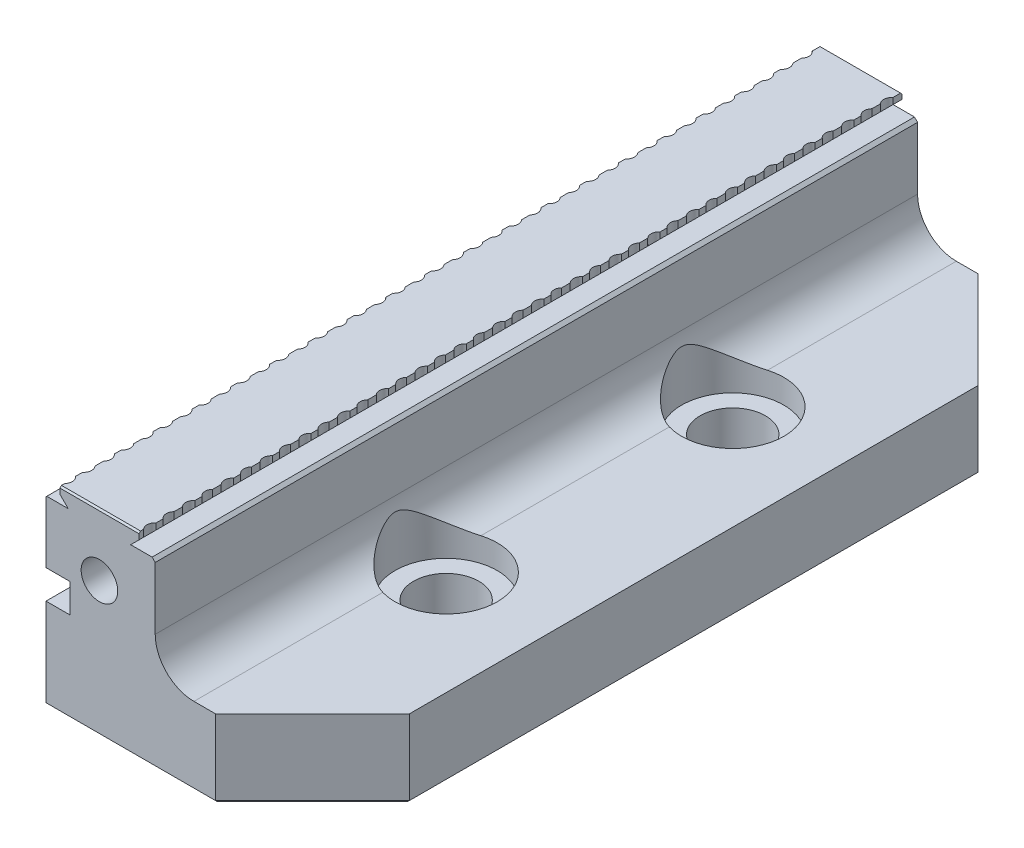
from build123d import *

# Parameters (mm, degrees)
BOSS_EXTRUDE1_DEPTH                = 62.5
CUT_EXTRUDE1_JAW_TOOTH_REACH       = 75.704
LPATTERN1_COUNT                    = 20
LPATTERN1_PITCH                    = 6.35762
CBORE_FOR_M10_SHCS1_D              = 10.7188
CBORE_FOR_M10_SHCS1_CBORE_D        = 16.764
CBORE_FOR_M10_SHCS1_CBORE_DEPTH    = 23.5
F_8_0MM_DOWEL_HOLE1_D              = 8.01623567
F_8_0MM_DOWEL_HOLE1_DEPTH          = 6.858
CHAMFER1_SIZE                      = 15.875
CHAMFER2_SIZE                      = 0.254
SKETCH9_W                          = 4.318
SKETCH9_H                          = 4.7498
CUT_EXTRUDE1_STOP_GROOVE_DEPTH     = 128.947895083
STEP_CHAMFER_SIZE                  = 0.381
OUTSIDE_DOVETAIL_CHAMFER_SIZE      = 0.508
INSIDE_DOVETAIL_CHAMFER_SIZE       = 0.508
BOTTOM_OUTSIDE_EDGE_CHAMFER_SIZE   = 0.381
OUTSIDE_JAW_FACE_EDGE_CHAMFER_SIZE = 0.381
FRONT_JAW_FACE_CHAMFERED_EDGE_SIZE = 0.381


with BuildPart() as part:
    # Sketch1 → Boss-Extrude1 (new, symmetric)
    with BuildSketch(Plane.XY):
        with BuildLine():
            Line((-22.0345, -16.129), (22.0345, -16.129))
            Line((22.0345, -16.129), (22.0345, -3.429))
            Line((22.0345, -3.429), (2.6035, -3.429))
            ThreePointArc((2.6035, -3.429), (-1.886628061, -1.569128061), (-3.7465, 2.921))
            Line((-3.7465, 2.921), (-3.7465, 13.629))
            Line((-3.7465, 13.629), (-7.7705, 13.629))
            Line((-7.7705, 13.629), (-6.2865, 15.113))
            Line((-6.2865, 15.113), (-6.2865, 16.129))
            Line((-6.2865, 16.129), (-19.4945, 16.129))
            Line((-19.4945, 16.129), (-19.4945, 15.113))
            Line((-19.4945, 15.113), (-18.0105, 13.629))
            Line((-18.0105, 13.629), (-22.0345, 13.629))
            Line((-22.0345, 13.629), (-22.0345, -16.129))
        make_face()
    extrude(amount=BOSS_EXTRUDE1_DEPTH, both=True)

    # Sketch8 → Cut-Extrude1 JAW TOOTH (cut, up to next)
    with BuildSketch(Plane(origin=(0, 16.129, 0), x_dir=(1, 0, 0), z_dir=(0, 1, 0)), mode=Mode.PRIVATE) as cut_extrude1_jaw_tooth_sk1:
        with BuildLine():
            Line((-19.4945, 62.5), (-19.4945, 60.976))
            ThreePointArc((-19.4945, 60.976), (-19.015440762, 60.048590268), (-19.3675, 59.06592))
            Line((-19.3675, 59.06592), (-19.3675, 57.67908))
            ThreePointArc((-19.3675, 57.67908), (-19.015440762, 56.696409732), (-19.4945, 55.769))
            Line((-19.4945, 55.769), (-22.233870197, 55.769))
            Line((-22.233870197, 55.769), (-22.233870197, 62.5))
            Line((-22.233870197, 62.5), (-19.4945, 62.5))
        make_face()
    cut_extrude1_jaw_tooth_tool1 = extrude(cut_extrude1_jaw_tooth_sk1.sketch, amount=-CUT_EXTRUDE1_JAW_TOOTH_REACH, mode=Mode.PRIVATE) & part.part
    # Sketch8 → Cut-Extrude1 JAW TOOTH (cut, up to next)
    with BuildSketch(Plane(origin=(0, 16.129, 0), x_dir=(1, 0, 0), z_dir=(0, 1, 0)), mode=Mode.PRIVATE) as cut_extrude1_jaw_tooth_sk2:
        with BuildLine():
            Line((-3.547129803, 62.5), (-6.2865, 62.5))
            Line((-6.2865, 62.5), (-6.2865, 60.976))
            ThreePointArc((-6.2865, 60.976), (-6.765559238, 60.048590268), (-6.4135, 59.06592))
            Line((-6.4135, 59.06592), (-6.4135, 57.67908))
            ThreePointArc((-6.4135, 57.67908), (-6.765559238, 56.696409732), (-6.2865, 55.769))
            Line((-6.2865, 55.769), (-3.547129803, 55.769))
            Line((-3.547129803, 55.769), (-3.547129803, 62.5))
        make_face()
    cut_extrude1_jaw_tooth_tool2 = extrude(cut_extrude1_jaw_tooth_sk2.sketch, amount=-CUT_EXTRUDE1_JAW_TOOTH_REACH, mode=Mode.PRIVATE) & part.part
    cut_extrude1_jaw_tooth_1 = cut_extrude1_jaw_tooth_tool1.solids().sort_by_distance((-20.745914, 16.129, -59.076435))[0]
    add(cut_extrude1_jaw_tooth_1, mode=Mode.SUBTRACT)
    cut_extrude1_jaw_tooth_2 = cut_extrude1_jaw_tooth_tool2.solids().sort_by_distance((-5.035086, 16.129, -59.076435))[0]
    add(cut_extrude1_jaw_tooth_2, mode=Mode.SUBTRACT)
    cut_extrude1_jaw_tooth = cut_extrude1_jaw_tooth_1 + cut_extrude1_jaw_tooth_2  # Cut-Extrude1 JAW TOOTH as one shape, for the pattern or mirror that repeats it

    # LPattern1: Cut-Extrude1 JAW TOOTH ×20
    with Locations(*[(0, 0, i * LPATTERN1_PITCH) for i in range(1, LPATTERN1_COUNT)]):
        add(cut_extrude1_jaw_tooth, mode=Mode.SUBTRACT)

    # CBORE for M10 SHCS1 (through all)
    with Locations(Plane(origin=(0, 16.129, 0), x_dir=(-1, 0, 0), z_dir=(0, 1, 0))):
        with Locations((-4.953, -23.495), (-4.953, 23.495)):
            CounterBoreHole(CBORE_FOR_M10_SHCS1_D / 2, CBORE_FOR_M10_SHCS1_CBORE_D / 2, CBORE_FOR_M10_SHCS1_CBORE_DEPTH)

    # 8.0mm Dowel Hole1
    with Locations(Plane.XZ.offset(16.129)):
        with Locations((16.652999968, 23.5), (-6.746999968, -23.5)):
            Hole(F_8_0MM_DOWEL_HOLE1_D / 2, depth=F_8_0MM_DOWEL_HOLE1_DEPTH)

    # Chamfer1
    chamfer1_edges = [part.edges().sort_by_distance(p)[0] for p in [
        (22.0345, -9.779, 62.5),
        (22.0345, -9.779, -62.5),
    ]]
    chamfer(chamfer1_edges, length=CHAMFER1_SIZE)

    # Chamfer2
    chamfer2_edges = [part.edges().sort_by_distance(p)[0] for p in [
        (-12.8905, 16.129, -62.5),
        (-12.8905, 16.129, 62.5),
    ]]
    chamfer(chamfer2_edges, length=CHAMFER2_SIZE)

    # Sketch9 → Cut-Extrude1 STOP GROOVE (cut, through all)
    with BuildSketch(Plane(origin=(0, 0, -62.5), x_dir=(-1, 0, 0), z_dir=(0, 0, -1))):
        with Locations((19.8755, 1.0541)):
            Rectangle(SKETCH9_W, SKETCH9_H)
    extrude(amount=-CUT_EXTRUDE1_STOP_GROOVE_DEPTH, mode=Mode.SUBTRACT)

    # Sketch13 → M6x1.0 Tapped Hole1 (revolve, cut)
    with BuildSketch(Plane(origin=(-12.8905, 5.969, -62.5), x_dir=(0, 1, 0), z_dir=(1, 0, 0))):
        Polygon((0, 0), (0, 16.488151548), (2.5, 14.986), (2.5, 11.9888), (3, 11.9888), (3, 0), align=None)
    m6x1_0_tapped_hole1 = revolve(axis=Axis((-12.8905, 5.969, -68.85), (0, 0, 1)), mode=Mode.SUBTRACT)

    # Mirror1: M6x1.0 Tapped Hole1 across plane
    add(m6x1_0_tapped_hole1.mirror(Plane.XY), mode=Mode.SUBTRACT)

    # STEP CHAMFER
    step_chamfer_edges = [part.edges().sort_by_distance(p)[0] for p in [
        (-22.0345, 3.429, 0),
        (-22.0345, -1.3208, 0),
    ]]
    chamfer(step_chamfer_edges, length=STEP_CHAMFER_SIZE)

    # OUTSIDE DOVETAIL CHAMFER
    outside_dovetail_chamfer_edges = [part.edges().sort_by_distance(p)[0] for p in [
        (-22.0345, 13.629, 0),
    ]]
    chamfer(outside_dovetail_chamfer_edges, length=OUTSIDE_DOVETAIL_CHAMFER_SIZE)

    # INSIDE DOVETAIL CHAMFER
    inside_dovetail_chamfer_edges = [part.edges().sort_by_distance(p)[0] for p in [
        (-3.7465, 13.629, 0),
    ]]
    chamfer(inside_dovetail_chamfer_edges, length=INSIDE_DOVETAIL_CHAMFER_SIZE)

    # BOTTOM OUTSIDE EDGE CHAMFER
    bottom_outside_edge_chamfer_edges = [part.edges().sort_by_distance(p)[0] for p in [
        (-7.9375, -16.129, -62.5),
        (-0.4064, -16.129, 23.495),
        (-0.4064, -16.129, -23.495),
        (22.0345, -16.129, 0),
        (14.097, -16.129, 54.5625),
        (14.097, -16.129, -54.5625),
        (-7.9375, -16.129, 62.5),
    ]]
    chamfer(bottom_outside_edge_chamfer_edges, length=BOTTOM_OUTSIDE_EDGE_CHAMFER_SIZE)

    # OUTSIDE JAW FACE EDGE CHAMFER
    outside_jaw_face_edge_chamfer_edges = [part.edges().sort_by_distance(p)[0] for p in [
        (-22.0345, 8.4655, -62.5),
        (-22.0345, -8.7249, -62.5),
        (-22.0345, 8.4655, 62.5),
        (-22.0345, -8.7249, 62.5),
    ]]
    chamfer(outside_jaw_face_edge_chamfer_edges, length=OUTSIDE_JAW_FACE_EDGE_CHAMFER_SIZE)

    # FRONT JAW FACE CHAMFERED EDGE
    front_jaw_face_chamfered_edge_edges = [part.edges().sort_by_distance(p)[0] for p in [
        (-22.0345, -16.129, 0),
    ]]
    chamfer(front_jaw_face_chamfered_edge_edges, length=FRONT_JAW_FACE_CHAMFERED_EDGE_SIZE)


solid = part.part
